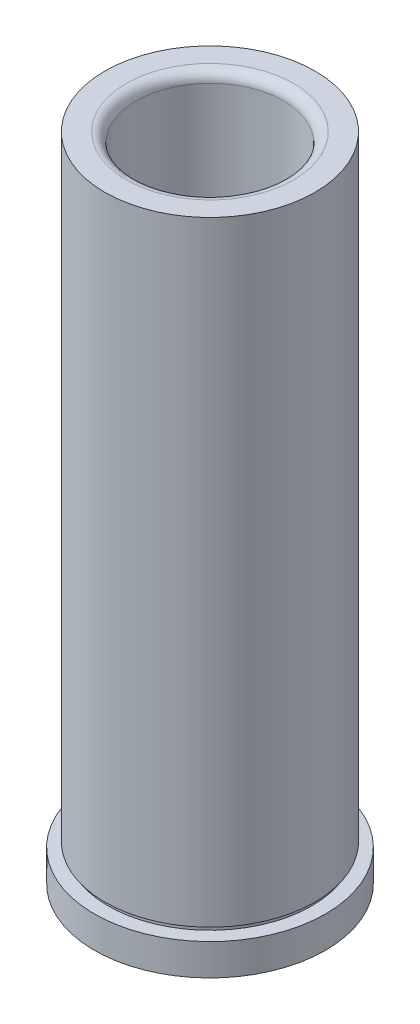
ISO-10303-21;
HEADER;
FILE_DESCRIPTION(('STEP AP214'),'2;1');
FILE_NAME('part.step','',(''),(''),'','','');
FILE_SCHEMA(('AUTOMOTIVE_DESIGN { 1 0 10303 214 1 1 1 1 }'));
ENDSEC;
DATA;
#1=APPLICATION_CONTEXT('core data for automotive mechanical design processes');
#2=APPLICATION_PROTOCOL_DEFINITION('international standard','automotive_design',2000,#1);
#3=PRODUCT_CONTEXT('',#1,'mechanical');
#4=PRODUCT('Part','Part','',(#3));
#5=PRODUCT_RELATED_PRODUCT_CATEGORY('part','',(#4));
#6=PRODUCT_DEFINITION_FORMATION('','',#4);
#7=PRODUCT_DEFINITION_CONTEXT('part definition',#1,'design');
#8=PRODUCT_DEFINITION('design','',#6,#7);
#9=PRODUCT_DEFINITION_SHAPE('','',#8);
#10=(LENGTH_UNIT() NAMED_UNIT(*) SI_UNIT(.MILLI.,.METRE.));
#11=(NAMED_UNIT(*) PLANE_ANGLE_UNIT() SI_UNIT($,.RADIAN.));
#12=(NAMED_UNIT(*) SI_UNIT($,.STERADIAN.) SOLID_ANGLE_UNIT());
#13=UNCERTAINTY_MEASURE_WITH_UNIT(LENGTH_MEASURE(1.E-05),#10,'distance_accuracy_value','');
#14=(GEOMETRIC_REPRESENTATION_CONTEXT(3) GLOBAL_UNCERTAINTY_ASSIGNED_CONTEXT((#13)) GLOBAL_UNIT_ASSIGNED_CONTEXT((#10,
#11,#12)) REPRESENTATION_CONTEXT('',''));
#15=CARTESIAN_POINT('',(0.,0.,0.));
#16=DIRECTION('',(0.,0.,1.));
#17=DIRECTION('',(1.,0.,0.));
#18=AXIS2_PLACEMENT_3D('',#15,#16,#17);
#19=CARTESIAN_POINT('',(-15.88135,98.4249999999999,0.));
#20=DIRECTION('',(0.,-1.,0.));
#21=DIRECTION('',(1.,0.,0.));
#22=AXIS2_PLACEMENT_3D('',#19,#20,#21);
#23=PLANE('',#22);
#24=CARTESIAN_POINT('',(-3.43649249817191E-13,98.425,0.));
#25=DIRECTION('',(0.,-1.,0.));
#26=DIRECTION('',(1.,0.,0.));
#27=AXIS2_PLACEMENT_3D('',#24,#25,#26);
#28=CIRCLE('',#27,12.6428499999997);
#29=CARTESIAN_POINT('',(12.6428499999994,98.425,0.));
#30=VERTEX_POINT('',#29);
#31=EDGE_CURVE('E36',#30,#30,#28,.T.);
#32=ORIENTED_EDGE('',*,*,#31,.T.);
#33=EDGE_LOOP('',(#32));
#34=FACE_BOUND('',#33,.T.);
#35=CARTESIAN_POINT('',(-3.43649249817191E-13,98.425,0.));
#36=DIRECTION('',(0.,-1.,0.));
#37=DIRECTION('',(1.,0.,0.));
#38=AXIS2_PLACEMENT_3D('',#35,#36,#37);
#39=CIRCLE('',#38,15.8813499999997);
#40=CARTESIAN_POINT('',(15.8813499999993,98.425,0.));
#41=VERTEX_POINT('',#40);
#42=EDGE_CURVE('E40',#41,#41,#39,.T.);
#43=ORIENTED_EDGE('',*,*,#42,.F.);
#44=EDGE_LOOP('',(#43));
#45=FACE_BOUND('',#44,.T.);
#46=ADVANCED_FACE('F29',(#34,#45),#23,.F.);
#47=CARTESIAN_POINT('',(3.49148336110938E-12,-1000.,0.));
#48=DIRECTION('',(0.,-1.,0.));
#49=DIRECTION('',(1.,0.,0.));
#50=AXIS2_PLACEMENT_3D('',#47,#48,#49);
#51=CYLINDRICAL_SURFACE('',#50,15.8813499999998);
#52=CARTESIAN_POINT('',(0.,5.52449999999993,0.));
#53=DIRECTION('',(0.,-1.,0.));
#54=DIRECTION('',(1.,0.,0.));
#55=AXIS2_PLACEMENT_3D('',#52,#53,#54);
#56=CIRCLE('',#55,15.88135);
#57=CARTESIAN_POINT('',(15.8813499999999,5.52449999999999,0.));
#58=VERTEX_POINT('',#57);
#59=EDGE_CURVE('E44',#58,#58,#56,.T.);
#60=ORIENTED_EDGE('',*,*,#59,.F.);
#61=EDGE_LOOP('',(#60));
#62=FACE_BOUND('',#61,.T.);
#63=ORIENTED_EDGE('',*,*,#42,.T.);
#64=EDGE_LOOP('',(#63));
#65=FACE_BOUND('',#64,.T.);
#66=ADVANCED_FACE('F121',(#62,#65),#51,.T.);
#67=CARTESIAN_POINT('',(-15.88135,5.5244999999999,0.));
#68=DIRECTION('',(0.,1.,0.));
#69=DIRECTION('',(-1.,0.,0.));
#70=AXIS2_PLACEMENT_3D('',#67,#68,#69);
#71=PLANE('',#70);
#72=CARTESIAN_POINT('',(0.,5.52449999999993,0.));
#73=DIRECTION('',(0.,-1.,0.));
#74=DIRECTION('',(1.,0.,0.));
#75=AXIS2_PLACEMENT_3D('',#72,#73,#74);
#76=CIRCLE('',#75,15.37335);
#77=CARTESIAN_POINT('',(15.3733499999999,5.52449999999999,0.));
#78=VERTEX_POINT('',#77);
#79=EDGE_CURVE('E49',#78,#78,#76,.T.);
#80=ORIENTED_EDGE('',*,*,#79,.F.);
#81=EDGE_LOOP('',(#80));
#82=FACE_BOUND('',#81,.T.);
#83=ORIENTED_EDGE('',*,*,#59,.T.);
#84=EDGE_LOOP('',(#83));
#85=FACE_BOUND('',#84,.T.);
#86=ADVANCED_FACE('F115',(#82,#85),#71,.F.);
#87=CARTESIAN_POINT('',(3.49148336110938E-12,-1000.,0.));
#88=DIRECTION('',(0.,-1.,0.));
#89=DIRECTION('',(1.,0.,0.));
#90=AXIS2_PLACEMENT_3D('',#87,#88,#89);
#91=CYLINDRICAL_SURFACE('',#90,15.37335);
#92=CARTESIAN_POINT('',(0.,4.7625,0.));
#93=DIRECTION('',(0.,-1.,0.));
#94=DIRECTION('',(1.,0.,0.));
#95=AXIS2_PLACEMENT_3D('',#92,#93,#94);
#96=CIRCLE('',#95,15.37335);
#97=CARTESIAN_POINT('',(15.37335,4.76250000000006,0.));
#98=VERTEX_POINT('',#97);
#99=EDGE_CURVE('E52',#98,#98,#96,.T.);
#100=ORIENTED_EDGE('',*,*,#99,.F.);
#101=EDGE_LOOP('',(#100));
#102=FACE_BOUND('',#101,.T.);
#103=ORIENTED_EDGE('',*,*,#79,.T.);
#104=EDGE_LOOP('',(#103));
#105=FACE_BOUND('',#104,.T.);
#106=ADVANCED_FACE('F109',(#102,#105),#91,.T.);
#107=CARTESIAN_POINT('',(-17.4625,4.7624999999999,0.));
#108=DIRECTION('',(0.,-1.,0.));
#109=DIRECTION('',(1.,0.,0.));
#110=AXIS2_PLACEMENT_3D('',#107,#108,#109);
#111=PLANE('',#110);
#112=CARTESIAN_POINT('',(0.,4.7625,0.));
#113=DIRECTION('',(0.,-1.,0.));
#114=DIRECTION('',(1.,0.,0.));
#115=AXIS2_PLACEMENT_3D('',#112,#113,#114);
#116=CIRCLE('',#115,17.4625);
#117=CARTESIAN_POINT('',(17.4625,4.76250000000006,0.));
#118=VERTEX_POINT('',#117);
#119=EDGE_CURVE('E55',#118,#118,#116,.T.);
#120=ORIENTED_EDGE('',*,*,#119,.F.);
#121=EDGE_LOOP('',(#120));
#122=FACE_BOUND('',#121,.T.);
#123=ORIENTED_EDGE('',*,*,#99,.T.);
#124=EDGE_LOOP('',(#123));
#125=FACE_BOUND('',#124,.T.);
#126=ADVANCED_FACE('F103',(#122,#125),#111,.F.);
#127=CARTESIAN_POINT('',(3.49148336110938E-12,-1000.,0.));
#128=DIRECTION('',(0.,-1.,0.));
#129=DIRECTION('',(1.,0.,0.));
#130=AXIS2_PLACEMENT_3D('',#127,#128,#129);
#131=CYLINDRICAL_SURFACE('',#130,17.4625);
#132=CARTESIAN_POINT('',(0.,0.,0.));
#133=DIRECTION('',(0.,-1.,0.));
#134=DIRECTION('',(1.,0.,0.));
#135=AXIS2_PLACEMENT_3D('',#132,#133,#134);
#136=CIRCLE('',#135,17.4625);
#137=CARTESIAN_POINT('',(17.4625,0.,0.));
#138=VERTEX_POINT('',#137);
#139=EDGE_CURVE('E58',#138,#138,#136,.T.);
#140=ORIENTED_EDGE('',*,*,#139,.F.);
#141=EDGE_LOOP('',(#140));
#142=FACE_BOUND('',#141,.T.);
#143=ORIENTED_EDGE('',*,*,#119,.T.);
#144=EDGE_LOOP('',(#143));
#145=FACE_BOUND('',#144,.T.);
#146=ADVANCED_FACE('F97',(#142,#145),#131,.T.);
#147=CARTESIAN_POINT('',(-13.1826,0.,0.));
#148=DIRECTION('',(0.,1.,0.));
#149=DIRECTION('',(-1.,0.,0.));
#150=AXIS2_PLACEMENT_3D('',#147,#148,#149);
#151=PLANE('',#150);
#152=CARTESIAN_POINT('',(0.,0.,0.));
#153=DIRECTION('',(0.,-1.,0.));
#154=DIRECTION('',(1.,0.,0.));
#155=AXIS2_PLACEMENT_3D('',#152,#153,#154);
#156=CIRCLE('',#155,13.1826);
#157=CARTESIAN_POINT('',(13.1826,0.,0.));
#158=VERTEX_POINT('',#157);
#159=EDGE_CURVE('E61',#158,#158,#156,.T.);
#160=ORIENTED_EDGE('',*,*,#159,.F.);
#161=EDGE_LOOP('',(#160));
#162=FACE_BOUND('',#161,.T.);
#163=ORIENTED_EDGE('',*,*,#139,.T.);
#164=EDGE_LOOP('',(#163));
#165=FACE_BOUND('',#164,.T.);
#166=ADVANCED_FACE('F91',(#162,#165),#151,.F.);
#167=CARTESIAN_POINT('',(0.,0.,0.));
#168=DIRECTION('',(0.,-1.,0.));
#169=DIRECTION('',(1.,0.,0.));
#170=AXIS2_PLACEMENT_3D('',#167,#168,#169);
#171=CONICAL_SURFACE('',#170,13.1826,0.785398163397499);
#172=CARTESIAN_POINT('',(0.,0.793749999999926,0.));
#173=DIRECTION('',(0.,-1.,0.));
#174=DIRECTION('',(1.,0.,0.));
#175=AXIS2_PLACEMENT_3D('',#172,#173,#174);
#176=CIRCLE('',#175,12.38885);
#177=CARTESIAN_POINT('',(12.38885,0.79374999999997,0.));
#178=VERTEX_POINT('',#177);
#179=EDGE_CURVE('E64',#178,#178,#176,.T.);
#180=ORIENTED_EDGE('',*,*,#179,.F.);
#181=EDGE_LOOP('',(#180));
#182=FACE_BOUND('',#181,.T.);
#183=ORIENTED_EDGE('',*,*,#159,.T.);
#184=EDGE_LOOP('',(#183));
#185=FACE_BOUND('',#184,.T.);
#186=ADVANCED_FACE('F85',(#182,#185),#171,.F.);
#187=CARTESIAN_POINT('',(3.49148336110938E-12,-1000.,0.));
#188=DIRECTION('',(0.,-1.,0.));
#189=DIRECTION('',(1.,0.,0.));
#190=AXIS2_PLACEMENT_3D('',#187,#188,#189);
#191=CYLINDRICAL_SURFACE('',#190,12.3888499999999);
#192=CARTESIAN_POINT('',(-1.8401863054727E-13,52.705,0.));
#193=DIRECTION('',(0.,-1.,0.));
#194=DIRECTION('',(1.,0.,0.));
#195=AXIS2_PLACEMENT_3D('',#192,#193,#194);
#196=CIRCLE('',#195,12.3888499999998);
#197=CARTESIAN_POINT('',(12.3888499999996,52.705,0.));
#198=VERTEX_POINT('',#197);
#199=EDGE_CURVE('E67',#198,#198,#196,.T.);
#200=ORIENTED_EDGE('',*,*,#199,.F.);
#201=EDGE_LOOP('',(#200));
#202=FACE_BOUND('',#201,.T.);
#203=ORIENTED_EDGE('',*,*,#179,.T.);
#204=EDGE_LOOP('',(#203));
#205=FACE_BOUND('',#204,.T.);
#206=ADVANCED_FACE('F79',(#202,#205),#191,.F.);
#207=CARTESIAN_POINT('',(-1.83880688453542E-13,52.7049999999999,0.));
#208=DIRECTION('',(0.,-1.,0.));
#209=DIRECTION('',(1.,0.,0.));
#210=AXIS2_PLACEMENT_3D('',#207,#208,#209);
#211=TOROIDAL_SURFACE('',#210,11.1188499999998,1.27000000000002);
#212=CARTESIAN_POINT('',(-1.88452814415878E-13,53.9749999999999,0.));
#213=DIRECTION('',(0.,-1.,0.));
#214=DIRECTION('',(1.,0.,0.));
#215=AXIS2_PLACEMENT_3D('',#212,#213,#214);
#216=CIRCLE('',#215,11.1188499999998);
#217=CARTESIAN_POINT('',(11.1188499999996,53.9749999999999,0.));
#218=VERTEX_POINT('',#217);
#219=EDGE_CURVE('E70',#218,#218,#216,.T.);
#220=ORIENTED_EDGE('',*,*,#219,.F.);
#221=EDGE_LOOP('',(#220));
#222=FACE_BOUND('',#221,.T.);
#223=ORIENTED_EDGE('',*,*,#199,.T.);
#224=EDGE_LOOP('',(#223));
#225=FACE_BOUND('',#224,.T.);
#226=ADVANCED_FACE('F76',(#222,#225),#211,.F.);
#227=CARTESIAN_POINT('',(3.49148336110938E-12,-1000.,0.));
#228=DIRECTION('',(0.,-1.,0.));
#229=DIRECTION('',(1.,0.,0.));
#230=AXIS2_PLACEMENT_3D('',#227,#228,#229);
#231=CYLINDRICAL_SURFACE('',#230,11.1188499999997);
#232=CARTESIAN_POINT('',(-3.3832822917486E-13,96.9009999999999,0.));
#233=DIRECTION('',(0.,-1.,0.));
#234=DIRECTION('',(1.,0.,0.));
#235=AXIS2_PLACEMENT_3D('',#232,#233,#234);
#236=CIRCLE('',#235,11.1188499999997);
#237=CARTESIAN_POINT('',(11.1188499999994,96.9009999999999,0.));
#238=VERTEX_POINT('',#237);
#239=EDGE_CURVE('E10',#238,#238,#236,.F.);
#240=ORIENTED_EDGE('',*,*,#239,.T.);
#241=EDGE_LOOP('',(#240));
#242=FACE_BOUND('',#241,.T.);
#243=ORIENTED_EDGE('',*,*,#219,.T.);
#244=EDGE_LOOP('',(#243));
#245=FACE_BOUND('',#244,.T.);
#246=ADVANCED_FACE('F74',(#242,#245),#231,.F.);
#247=CARTESIAN_POINT('',(-3.3832822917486E-13,96.9009999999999,0.));
#248=DIRECTION('',(0.,-1.,0.));
#249=DIRECTION('',(1.,0.,0.));
#250=AXIS2_PLACEMENT_3D('',#247,#248,#249);
#251=TOROIDAL_SURFACE('',#250,12.6428499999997,1.524);
#252=ORIENTED_EDGE('',*,*,#239,.F.);
#253=EDGE_LOOP('',(#252));
#254=FACE_BOUND('',#253,.T.);
#255=ORIENTED_EDGE('',*,*,#31,.F.);
#256=EDGE_LOOP('',(#255));
#257=FACE_BOUND('',#256,.T.);
#258=ADVANCED_FACE('F31',(#254,#257),#251,.T.);
#259=CLOSED_SHELL('',(#46,#66,#86,#106,#126,#146,#166,#186,#206,#226,#246,#258));
#260=MANIFOLD_SOLID_BREP('B2',#259);
#261=ADVANCED_BREP_SHAPE_REPRESENTATION('',(#18,#260),#14);
#262=SHAPE_DEFINITION_REPRESENTATION(#9,#261);
ENDSEC;
END-ISO-10303-21;
